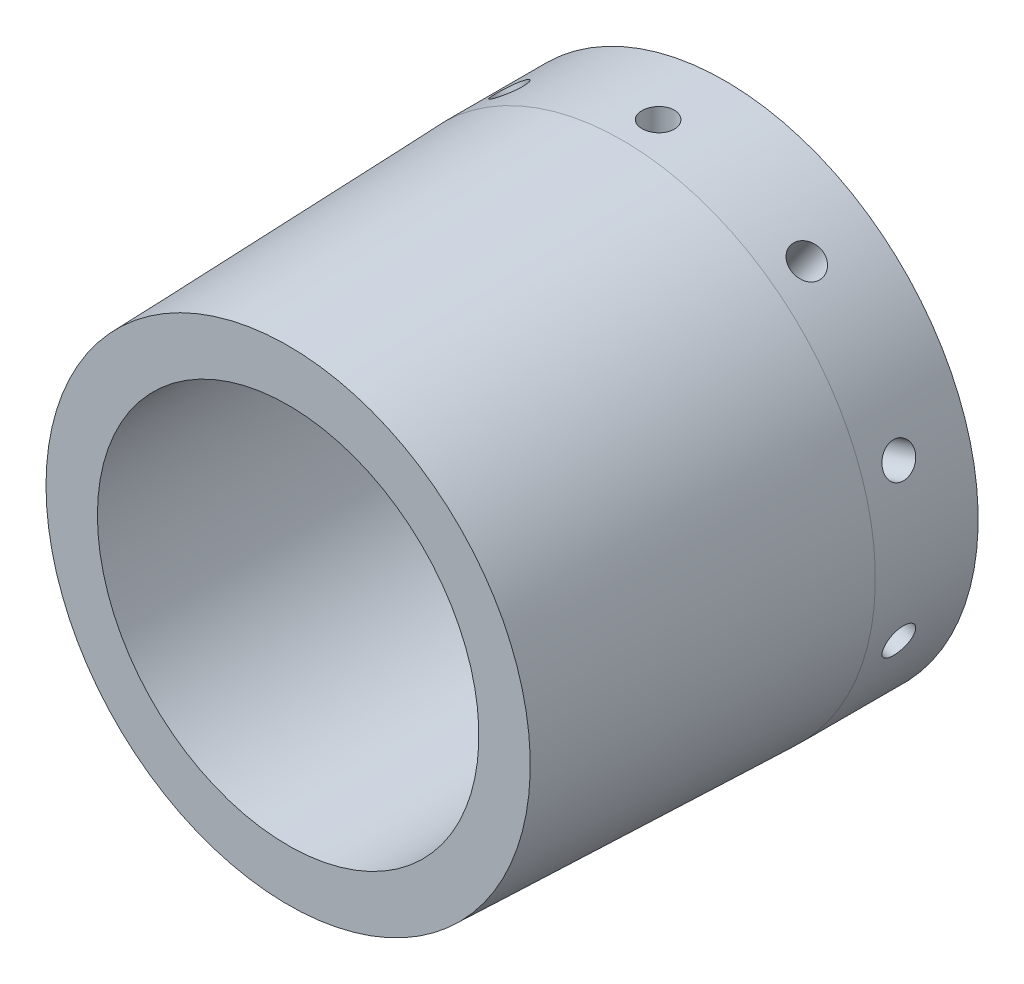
from build123d import *

# Parameters (mm, degrees)
CUT_EXTRUDE2_REACH      = 121.986
CUT_EXTRUDE2_END_RADIUS = 28.5115
SKETCH3_R               = 2.413
CIRPATTERN3_COUNT       = 10


with BuildPart() as part:
    # Sketch2 → Revolve1 (revolve)
    with BuildSketch(Plane(origin=(0, 0, 0), x_dir=(1, 0, 0), z_dir=(0, 1, 0))):
        Polygon((0, 0), (-9.3345, 0), (-9.3345, -15.367), (-7.6835, -65.300225), (0, -65.300225), align=None)
    revolve(axis=Axis((28.5115, 0, 0), (0, 0, 1)))

    # Cut-Extrude2: up to this cylinder (the profile starts outside it)
    cut_extrude2_end = Plane(origin=(28.5115, 0, 9.99998), z_dir=(0, 0, -1)) * Cylinder(CUT_EXTRUDE2_END_RADIUS, 301.995, mode=Mode.PRIVATE)
    # Sketch3 → Cut-Extrude2 (cut, up to the surface)
    with BuildSketch(Plane(origin=(0, 37.846, 0), x_dir=(1, 0, 0), z_dir=(0, 1, 0)), mode=Mode.PRIVATE) as cut_extrude2_sk1:
        with Locations(Location((28.5115, -9.99998, 0), (0, 0, 270))):
            Circle(SKETCH3_R)
    cut_extrude2_tool1 = extrude(cut_extrude2_sk1.sketch, amount=-CUT_EXTRUDE2_REACH, mode=Mode.PRIVATE) - cut_extrude2_end
    cut_extrude2 = cut_extrude2_tool1.solids().sort_by_distance((28.5115, 37.846, 9.99998))[0]
    add(cut_extrude2, mode=Mode.SUBTRACT)

    # CirPattern3: Cut-Extrude2 ×10 about axis
    cirpattern3_axis = Axis((28.5115, 0, 0), (0, 0, -1))
    for i in range(1, CIRPATTERN3_COUNT):
        add(cut_extrude2.rotate(cirpattern3_axis, i * 360 / CIRPATTERN3_COUNT), mode=Mode.SUBTRACT)


solid = part.part
